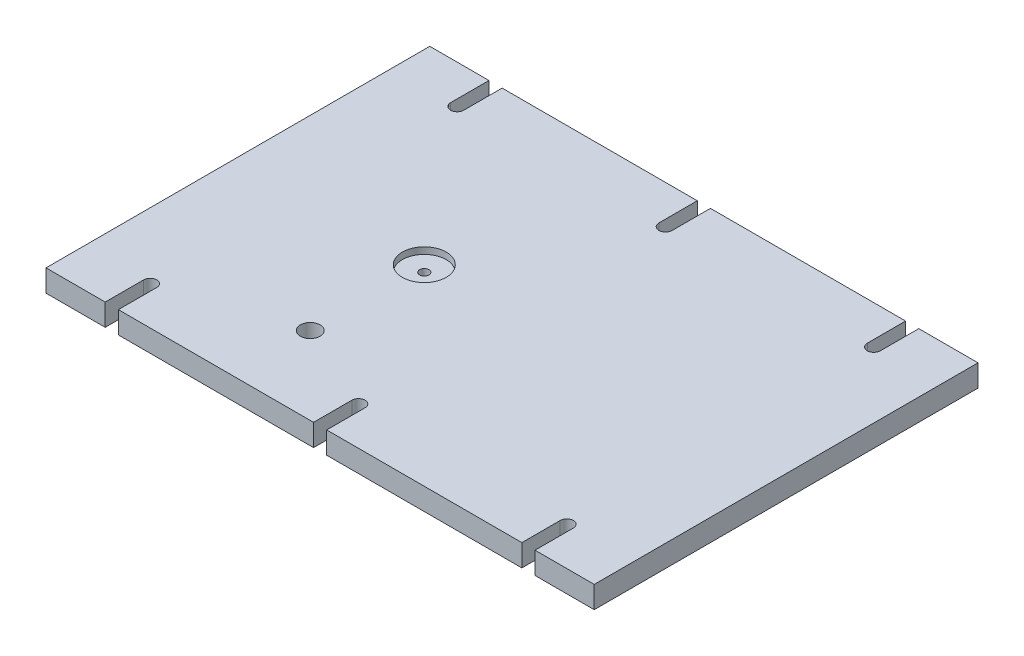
from build123d import *

# Parameters (mm, degrees)
ESQUISSE1_W             = 500
ESQUISSE1_H             = 20
EXTRUSION1_DEPTH        = 175
TROU_TARAUD_M10X1_51_D  = 8.5
ESQUISSE4_R             = 9
ENL_V_MAT_EXTRU_2_DEPTH = 348.886475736
ESQUISSE5_R             = 20
ENL_V_MAT_EXTRU_3_DEPTH = 6
ENL_V_MAT_EXTRU_4_DEPTH = 348.886475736


with BuildPart() as part:
    # Esquisse1 → Extrusion1 (new, symmetric)
    with BuildSketch(Plane.XY):
        with Locations((50, -10)):
            Rectangle(ESQUISSE1_W, ESQUISSE1_H)
    extrude(amount=EXTRUSION1_DEPTH, both=True)

    # Trou taraud_ M10x1.51 (through all)
    with Locations(Plane(origin=(0, 0, 0), x_dir=(-1, 0, 0), z_dir=(0, 1, 0))):
        with Locations((30, 0)):
            Hole(TROU_TARAUD_M10X1_51_D / 2)

    # Esquisse4 → Enl_v. mat.-Extru.2 (cut, through all)
    with BuildSketch(Plane(origin=(0, 0, 0), x_dir=(1, 0, 0), z_dir=(0, 1, 0))):
        with Locations(Location((-30, -104, 0), (0, 0, 270))):
            Circle(ESQUISSE4_R)
    extrude(amount=-ENL_V_MAT_EXTRU_2_DEPTH, mode=Mode.SUBTRACT)

    # Esquisse5 → Enl_v. mat.-Extru.3 (cut)
    with BuildSketch(Plane(origin=(0, 0, 0), x_dir=(1, 0, 0), z_dir=(0, 1, 0))):
        with Locations(Location((-30, 0, 0), (0, 0, 270))):
            Circle(ESQUISSE5_R)
    extrude(amount=-ENL_V_MAT_EXTRU_3_DEPTH, mode=Mode.SUBTRACT)

    # Esquisse6 → Enl_v. mat.-Extru.4 (cut, through all)
    with BuildSketch(Plane(origin=(0, 0, 0), x_dir=(1, 0, 0), z_dir=(0, 1, 0))):
        with BuildLine():
            Line((-146, -175), (-134, -175))
            Line((-134, -175), (-134, -140))
            ThreePointArc((-134, -140), (-140, -134), (-146, -140))
            Line((-146, -140), (-146, -175))
        make_face()
        with BuildLine():
            Line((234, -175), (234, -140))
            ThreePointArc((234, -140), (240, -134), (246, -140))
            Line((246, -140), (246, -175))
            Line((246, -175), (234, -175))
        make_face()
        with BuildLine():
            Line((246, 175), (234, 175))
            Line((234, 175), (234, 140))
            ThreePointArc((234, 140), (240, 134), (246, 140))
            Line((246, 140), (246, 175))
        make_face()
        with BuildLine():
            Line((-134, 175), (-134, 140))
            ThreePointArc((-134, 140), (-140, 134), (-146, 140))
            Line((-146, 140), (-146, 175))
            Line((-146, 175), (-134, 175))
        make_face()
        with BuildLine():
            Line((56, 175), (56, 140))
            ThreePointArc((56, 140), (50, 134), (44, 140))
            Line((44, 140), (44, 175))
            Line((44, 175), (56, 175))
        make_face()
        with BuildLine():
            Line((44, -175), (56, -175))
            Line((56, -175), (56, -140))
            ThreePointArc((56, -140), (50, -134), (44, -140))
            Line((44, -140), (44, -175))
        make_face()
    extrude(amount=-ENL_V_MAT_EXTRU_4_DEPTH, mode=Mode.SUBTRACT)


solid = part.part
